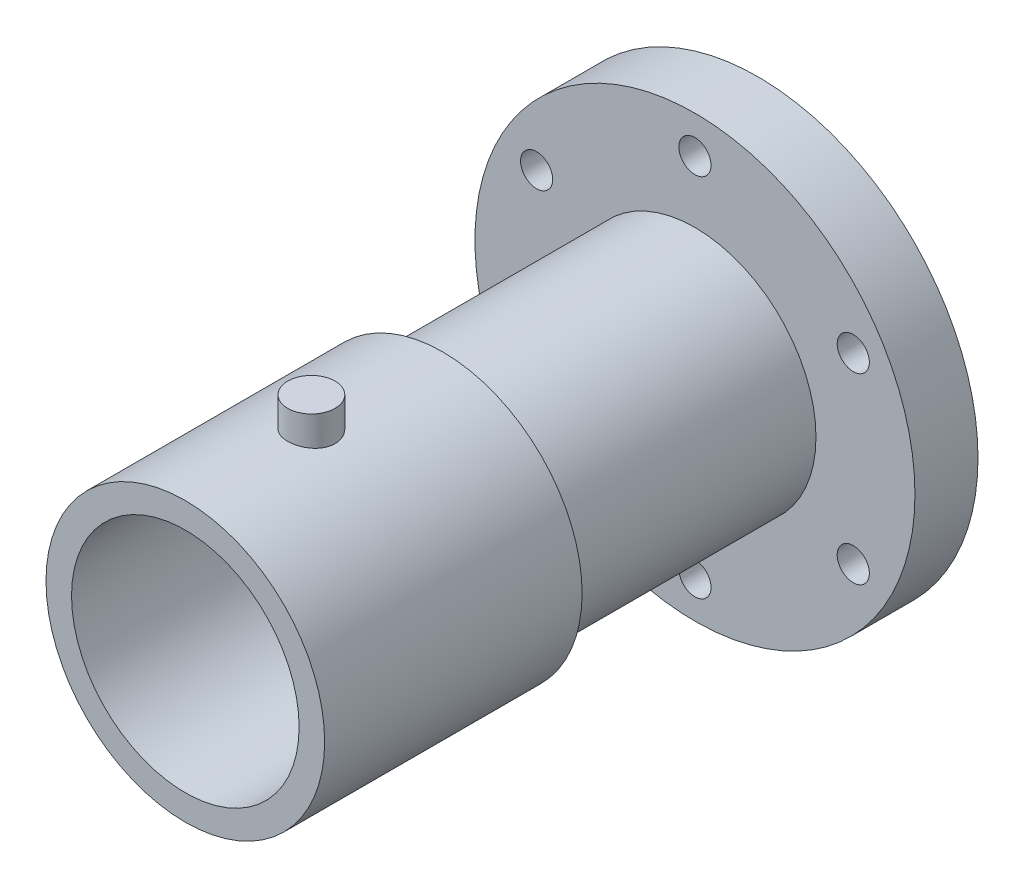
from build123d import *

# Parameters (mm, degrees)
SKETCH1_R                  = 44.323
EXTRUDE1_DEPTH             = 12.7
SKETCH9_R                  = 24.384
EXTRUDE4_DEPTH             = 50.8
SKETCH10_R                 = 28.067
EXTRUDE5_DEPTH             = 51.8668
SKETCH11_R                 = 22.9235
CUT_EXTRUDE4_DEPTH         = 44.45
SKETCH8_R                  = 3.2385
CUT_EXTRUDE3_DEPTH         = 121.289353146
CIRPATTERN2_COUNT          = 6
EXTRUDE6_REACH             = 145.228
EXTRUDE6_END_RADIUS        = 28.067
SKETCH12_R                 = 4.7625
EXTRUDE6_DIRECTION_2_DEPTH = 5.7658


with BuildPart() as part:
    # Sketch1 → Extrude1 (new body)
    with BuildSketch(Plane.XY):
        Circle(SKETCH1_R)
    extrude(amount=EXTRUDE1_DEPTH)

    # Sketch9 → Extrude4 (add)
    with BuildSketch(Plane.XY.offset(12.7)):
        Circle(SKETCH9_R)
    extrude(amount=EXTRUDE4_DEPTH)

    # Sketch10 → Extrude5 (add)
    with BuildSketch(Plane.XY.offset(63.5)):
        Circle(SKETCH10_R)
    extrude(amount=EXTRUDE5_DEPTH)

    # Sketch11 → Cut-Extrude4 (cut)
    with BuildSketch(Plane.XY.offset(115.3668)):
        Circle(SKETCH11_R)
    extrude(amount=-CUT_EXTRUDE4_DEPTH, mode=Mode.SUBTRACT)

    # Sketch8 → Cut-Extrude3 (cut, through all)
    with BuildSketch(Plane.XY.offset(12.7)):
        with Locations((0, 36.83)):
            Circle(SKETCH8_R)
    cut_extrude3 = extrude(amount=-CUT_EXTRUDE3_DEPTH, mode=Mode.SUBTRACT)

    # CirPattern2: Cut-Extrude3 ×6 about axis
    cirpattern2_axis = Axis((0, 0, 0), (0, 0, 1))
    for i in range(1, CIRPATTERN2_COUNT):
        add(cut_extrude3.rotate(cirpattern2_axis, i * 360 / CIRPATTERN2_COUNT), mode=Mode.SUBTRACT)

    # Extrude6: up to this cylinder (the profile starts outside it)
    extrude6_end = Plane(origin=(0, 0, 89.9668), z_dir=(0, 0, -1)) * Cylinder(EXTRUDE6_END_RADIUS, 347.59, mode=Mode.PRIVATE)
    # Sketch12 → Extrude6 (add, up to the surface)
    with BuildSketch(Plane(origin=(0, 28.067, 0), x_dir=(-1, 0, 0), z_dir=(0, 1, 0)), mode=Mode.PRIVATE) as extrude6_sk1:
        with Locations(Location((0, 89.9668, 0), (0, 0, 90))):
            Circle(SKETCH12_R)
    extrude6_tool1 = extrude(extrude6_sk1.sketch, amount=-EXTRUDE6_REACH, mode=Mode.PRIVATE) - extrude6_end
    add(extrude6_tool1.solids().sort_by_distance((0, 28.067, 89.9668))[0])
    add(extrude6_tool1.solids().sort_by_distance((0, 28.067, 89.9668))[1])

    # Sketch12 → Extrude6 direction 2 (add)
    with BuildSketch(Plane(origin=(0, 28.067, 0), x_dir=(-1, 0, 0), z_dir=(0, 1, 0))):
        with Locations(Location((0, 89.9668, 0), (0, 0, 90))):
            Circle(SKETCH12_R)
    extrude(amount=EXTRUDE6_DIRECTION_2_DEPTH)


solid = part.part
